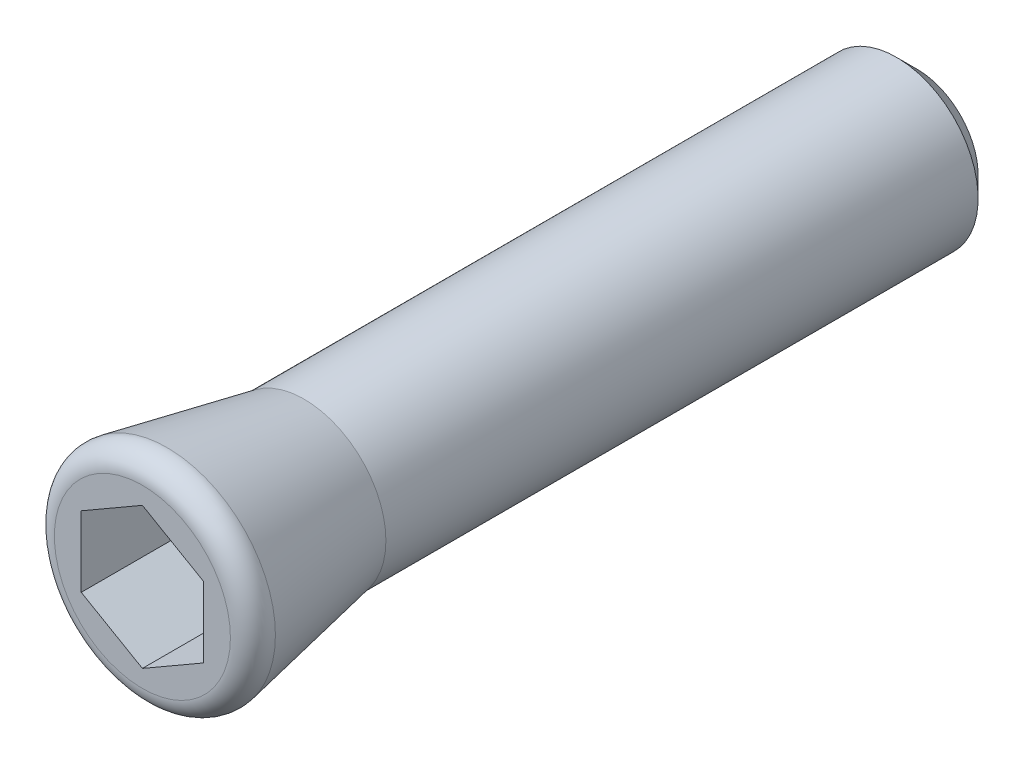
ISO-10303-21;
HEADER;
FILE_DESCRIPTION(('STEP AP214'),'2;1');
FILE_NAME('part.step','',(''),(''),'','','');
FILE_SCHEMA(('AUTOMOTIVE_DESIGN { 1 0 10303 214 1 1 1 1 }'));
ENDSEC;
DATA;
#1=APPLICATION_CONTEXT('core data for automotive mechanical design processes');
#2=APPLICATION_PROTOCOL_DEFINITION('international standard','automotive_design',2000,#1);
#3=PRODUCT_CONTEXT('',#1,'mechanical');
#4=PRODUCT('Part','Part','',(#3));
#5=PRODUCT_RELATED_PRODUCT_CATEGORY('part','',(#4));
#6=PRODUCT_DEFINITION_FORMATION('','',#4);
#7=PRODUCT_DEFINITION_CONTEXT('part definition',#1,'design');
#8=PRODUCT_DEFINITION('design','',#6,#7);
#9=PRODUCT_DEFINITION_SHAPE('','',#8);
#10=(LENGTH_UNIT() NAMED_UNIT(*) SI_UNIT(.MILLI.,.METRE.));
#11=(NAMED_UNIT(*) PLANE_ANGLE_UNIT() SI_UNIT($,.RADIAN.));
#12=(NAMED_UNIT(*) SI_UNIT($,.STERADIAN.) SOLID_ANGLE_UNIT());
#13=UNCERTAINTY_MEASURE_WITH_UNIT(LENGTH_MEASURE(1.E-05),#10,'distance_accuracy_value','');
#14=(GEOMETRIC_REPRESENTATION_CONTEXT(3) GLOBAL_UNCERTAINTY_ASSIGNED_CONTEXT((#13)) GLOBAL_UNIT_ASSIGNED_CONTEXT((#10,
#11,#12)) REPRESENTATION_CONTEXT('',''));
#15=CARTESIAN_POINT('',(0.,0.,0.));
#16=DIRECTION('',(0.,0.,1.));
#17=DIRECTION('',(1.,0.,0.));
#18=AXIS2_PLACEMENT_3D('',#15,#16,#17);
#19=CARTESIAN_POINT('',(0.,0.,-7.916));
#20=DIRECTION('',(0.,0.,-1.));
#21=DIRECTION('',(-1.,0.,0.));
#22=AXIS2_PLACEMENT_3D('',#19,#20,#21);
#23=CYLINDRICAL_SURFACE('',#22,4.);
#24=CARTESIAN_POINT('',(0.,0.,-36.996));
#25=DIRECTION('',(0.,0.,-1.));
#26=DIRECTION('',(-1.,0.,0.));
#27=AXIS2_PLACEMENT_3D('',#24,#25,#26);
#28=CIRCLE('',#27,4.);
#29=CARTESIAN_POINT('',(-4.,0.,-36.996));
#30=VERTEX_POINT('',#29);
#31=EDGE_CURVE('E22',#30,#30,#28,.F.);
#32=ORIENTED_EDGE('',*,*,#31,.T.);
#33=EDGE_LOOP('',(#32));
#34=FACE_BOUND('',#33,.T.);
#35=CARTESIAN_POINT('',(0.,0.,-7.9375));
#36=DIRECTION('',(0.,0.,-1.));
#37=DIRECTION('',(-1.,0.,0.));
#38=AXIS2_PLACEMENT_3D('',#35,#36,#37);
#39=CIRCLE('',#38,4.);
#40=CARTESIAN_POINT('',(-4.,0.,-7.9375));
#41=VERTEX_POINT('',#40);
#42=EDGE_CURVE('E132',#41,#41,#39,.T.);
#43=ORIENTED_EDGE('',*,*,#42,.T.);
#44=EDGE_LOOP('',(#43));
#45=FACE_BOUND('',#44,.T.);
#46=ADVANCED_FACE('F14',(#34,#45),#23,.T.);
#47=CARTESIAN_POINT('',(0.,0.,0.));
#48=DIRECTION('',(0.,0.,1.));
#49=DIRECTION('',(1.,0.,0.));
#50=AXIS2_PLACEMENT_3D('',#47,#48,#49);
#51=PLANE('',#50);
#52=DIRECTION('',(0.866025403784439,-0.5,0.));
#53=VECTOR('',#52,1.);
#54=CARTESIAN_POINT('',(-3.,-1.73205080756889,0.));
#55=LINE('',#54,#53);
#56=CARTESIAN_POINT('',(-3.,-1.73205080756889,0.));
#57=VERTEX_POINT('',#56);
#58=CARTESIAN_POINT('',(0.,-3.46410161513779,0.));
#59=VERTEX_POINT('',#58);
#60=EDGE_CURVE('E29',#57,#59,#55,.T.);
#61=ORIENTED_EDGE('',*,*,#60,.F.);
#62=DIRECTION('',(0.,-1.,0.));
#63=VECTOR('',#62,1.);
#64=CARTESIAN_POINT('',(-3.,1.73205080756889,0.));
#65=LINE('',#64,#63);
#66=CARTESIAN_POINT('',(-3.,1.73205080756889,0.));
#67=VERTEX_POINT('',#66);
#68=EDGE_CURVE('E99',#67,#57,#65,.T.);
#69=ORIENTED_EDGE('',*,*,#68,.F.);
#70=DIRECTION('',(-0.866025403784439,-0.5,0.));
#71=VECTOR('',#70,1.);
#72=CARTESIAN_POINT('',(0.,3.46410161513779,0.));
#73=LINE('',#72,#71);
#74=CARTESIAN_POINT('',(0.,3.46410161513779,0.));
#75=VERTEX_POINT('',#74);
#76=EDGE_CURVE('E93',#75,#67,#73,.T.);
#77=ORIENTED_EDGE('',*,*,#76,.F.);
#78=DIRECTION('',(-0.866025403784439,0.5,0.));
#79=VECTOR('',#78,1.);
#80=CARTESIAN_POINT('',(3.,1.73205080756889,0.));
#81=LINE('',#80,#79);
#82=CARTESIAN_POINT('',(3.,1.73205080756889,0.));
#83=VERTEX_POINT('',#82);
#84=EDGE_CURVE('E91',#83,#75,#81,.T.);
#85=ORIENTED_EDGE('',*,*,#84,.F.);
#86=DIRECTION('',(0.,1.,0.));
#87=VECTOR('',#86,1.);
#88=CARTESIAN_POINT('',(3.,-1.73205080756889,0.));
#89=LINE('',#88,#87);
#90=CARTESIAN_POINT('',(3.,-1.73205080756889,0.));
#91=VERTEX_POINT('',#90);
#92=EDGE_CURVE('E72',#91,#83,#89,.T.);
#93=ORIENTED_EDGE('',*,*,#92,.F.);
#94=DIRECTION('',(0.866025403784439,0.5,0.));
#95=VECTOR('',#94,1.);
#96=CARTESIAN_POINT('',(0.,-3.46410161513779,0.));
#97=LINE('',#96,#95);
#98=EDGE_CURVE('E83',#59,#91,#97,.T.);
#99=ORIENTED_EDGE('',*,*,#98,.F.);
#100=EDGE_LOOP('',(#61,#69,#77,#85,#93,#99));
#101=FACE_BOUND('',#100,.T.);
#102=CARTESIAN_POINT('',(0.,0.,0.));
#103=DIRECTION('',(0.,0.,1.));
#104=DIRECTION('',(1.,0.,0.));
#105=AXIS2_PLACEMENT_3D('',#102,#103,#104);
#106=CIRCLE('',#105,4.318);
#107=CARTESIAN_POINT('',(4.318,0.,0.));
#108=VERTEX_POINT('',#107);
#109=EDGE_CURVE('E117',#108,#108,#106,.T.);
#110=ORIENTED_EDGE('',*,*,#109,.T.);
#111=EDGE_LOOP('',(#110));
#112=FACE_BOUND('',#111,.T.);
#113=ADVANCED_FACE('F87',(#101,#112),#51,.T.);
#114=CARTESIAN_POINT('',(0.,0.,-1.20986193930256));
#115=DIRECTION('',(0.,0.,1.));
#116=DIRECTION('',(1.,0.,0.));
#117=AXIS2_PLACEMENT_3D('',#114,#115,#116);
#118=CONICAL_SURFACE('',#117,5.31533321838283,0.19198621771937);
#119=CARTESIAN_POINT('',(0.,0.,-7.9375));
#120=DIRECTION('',(0.,0.,1.));
#121=DIRECTION('',(1.,0.,0.));
#122=AXIS2_PLACEMENT_3D('',#119,#120,#121);
#123=CIRCLE('',#122,4.00761285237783);
#124=CARTESIAN_POINT('',(4.00761285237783,0.,-7.9375));
#125=VERTEX_POINT('',#124);
#126=EDGE_CURVE('E129',#125,#125,#123,.T.);
#127=ORIENTED_EDGE('',*,*,#126,.T.);
#128=EDGE_LOOP('',(#127));
#129=FACE_BOUND('',#128,.T.);
#130=CARTESIAN_POINT('',(0.,0.,-1.20986193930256));
#131=DIRECTION('',(0.,0.,1.));
#132=DIRECTION('',(1.,0.,0.));
#133=AXIS2_PLACEMENT_3D('',#130,#131,#132);
#134=CIRCLE('',#133,5.31533321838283);
#135=CARTESIAN_POINT('',(5.31533321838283,0.,-1.20986193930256));
#136=VERTEX_POINT('',#135);
#137=EDGE_CURVE('E126',#136,#136,#134,.T.);
#138=ORIENTED_EDGE('',*,*,#137,.F.);
#139=EDGE_LOOP('',(#138));
#140=FACE_BOUND('',#139,.T.);
#141=ADVANCED_FACE('F162',(#129,#140),#118,.T.);
#142=CARTESIAN_POINT('',(0.,0.,-1.016));
#143=DIRECTION('',(0.,0.,1.));
#144=DIRECTION('',(1.,0.,0.));
#145=AXIS2_PLACEMENT_3D('',#142,#143,#144);
#146=TOROIDAL_SURFACE('',#145,4.318,1.016);
#147=ORIENTED_EDGE('',*,*,#137,.T.);
#148=EDGE_LOOP('',(#147));
#149=FACE_BOUND('',#148,.T.);
#150=ORIENTED_EDGE('',*,*,#109,.F.);
#151=EDGE_LOOP('',(#150));
#152=FACE_BOUND('',#151,.T.);
#153=ADVANCED_FACE('F164',(#149,#152),#146,.T.);
#154=CARTESIAN_POINT('',(0.,5.95376,-7.9375));
#155=DIRECTION('',(0.,0.,-1.));
#156=DIRECTION('',(-1.,0.,0.));
#157=AXIS2_PLACEMENT_3D('',#154,#155,#156);
#158=PLANE('',#157);
#159=ORIENTED_EDGE('',*,*,#42,.F.);
#160=EDGE_LOOP('',(#159));
#161=FACE_BOUND('',#160,.T.);
#162=ORIENTED_EDGE('',*,*,#126,.F.);
#163=EDGE_LOOP('',(#162));
#164=FACE_BOUND('',#163,.T.);
#165=ADVANCED_FACE('F16',(#161,#164),#158,.T.);
#166=CARTESIAN_POINT('',(0.,0.,-37.996));
#167=DIRECTION('',(0.,0.,-1.));
#168=DIRECTION('',(-1.,0.,0.));
#169=AXIS2_PLACEMENT_3D('',#166,#167,#168);
#170=PLANE('',#169);
#171=CARTESIAN_POINT('',(0.,0.,-37.996));
#172=DIRECTION('',(0.,0.,-1.));
#173=DIRECTION('',(-1.,0.,0.));
#174=AXIS2_PLACEMENT_3D('',#171,#172,#173);
#175=CIRCLE('',#174,3.);
#176=CARTESIAN_POINT('',(-3.,0.,-37.996));
#177=VERTEX_POINT('',#176);
#178=EDGE_CURVE('E9',#177,#177,#175,.T.);
#179=ORIENTED_EDGE('',*,*,#178,.T.);
#180=EDGE_LOOP('',(#179));
#181=FACE_BOUND('',#180,.T.);
#182=ADVANCED_FACE('F142',(#181),#170,.T.);
#183=CARTESIAN_POINT('',(0.,0.,-36.996));
#184=DIRECTION('',(0.,0.,1.));
#185=DIRECTION('',(1.,0.,0.));
#186=AXIS2_PLACEMENT_3D('',#183,#184,#185);
#187=CONICAL_SURFACE('',#186,4.,0.785398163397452);
#188=ORIENTED_EDGE('',*,*,#178,.F.);
#189=EDGE_LOOP('',(#188));
#190=FACE_BOUND('',#189,.T.);
#191=ORIENTED_EDGE('',*,*,#31,.F.);
#192=EDGE_LOOP('',(#191));
#193=FACE_BOUND('',#192,.T.);
#194=ADVANCED_FACE('F139',(#190,#193),#187,.T.);
#195=CARTESIAN_POINT('',(-3.,-1.73205080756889,-4.5));
#196=DIRECTION('',(-0.5,-0.866025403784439,0.));
#197=DIRECTION('',(-0.866025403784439,0.5,0.));
#198=AXIS2_PLACEMENT_3D('',#195,#196,#197);
#199=PLANE('',#198);
#200=ORIENTED_EDGE('',*,*,#60,.T.);
#201=DIRECTION('',(0.,0.,1.));
#202=VECTOR('',#201,1.);
#203=CARTESIAN_POINT('',(0.,-3.46410161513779,-4.5));
#204=LINE('',#203,#202);
#205=CARTESIAN_POINT('',(0.,-3.46410161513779,-4.5));
#206=VERTEX_POINT('',#205);
#207=EDGE_CURVE('E80',#206,#59,#204,.T.);
#208=ORIENTED_EDGE('',*,*,#207,.F.);
#209=DIRECTION('',(0.866025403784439,-0.5,0.));
#210=VECTOR('',#209,1.);
#211=CARTESIAN_POINT('',(-3.,-1.73205080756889,-4.5));
#212=LINE('',#211,#210);
#213=CARTESIAN_POINT('',(-3.,-1.73205080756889,-4.5));
#214=VERTEX_POINT('',#213);
#215=EDGE_CURVE('E101',#214,#206,#212,.T.);
#216=ORIENTED_EDGE('',*,*,#215,.F.);
#217=DIRECTION('',(0.,0.,1.));
#218=VECTOR('',#217,1.);
#219=CARTESIAN_POINT('',(-3.,-1.73205080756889,-4.5));
#220=LINE('',#219,#218);
#221=EDGE_CURVE('E36',#214,#57,#220,.T.);
#222=ORIENTED_EDGE('',*,*,#221,.T.);
#223=EDGE_LOOP('',(#200,#208,#216,#222));
#224=FACE_BOUND('',#223,.T.);
#225=ADVANCED_FACE('F141',(#224),#199,.F.);
#226=CARTESIAN_POINT('',(-3.,1.73205080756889,-4.5));
#227=DIRECTION('',(-1.,0.,0.));
#228=DIRECTION('',(0.,1.,0.));
#229=AXIS2_PLACEMENT_3D('',#226,#227,#228);
#230=PLANE('',#229);
#231=ORIENTED_EDGE('',*,*,#68,.T.);
#232=ORIENTED_EDGE('',*,*,#221,.F.);
#233=DIRECTION('',(0.,-1.,0.));
#234=VECTOR('',#233,1.);
#235=CARTESIAN_POINT('',(-3.,1.73205080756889,-4.5));
#236=LINE('',#235,#234);
#237=CARTESIAN_POINT('',(-3.,1.73205080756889,-4.5));
#238=VERTEX_POINT('',#237);
#239=EDGE_CURVE('E113',#238,#214,#236,.T.);
#240=ORIENTED_EDGE('',*,*,#239,.F.);
#241=DIRECTION('',(0.,0.,1.));
#242=VECTOR('',#241,1.);
#243=CARTESIAN_POINT('',(-3.,1.73205080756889,-4.5));
#244=LINE('',#243,#242);
#245=EDGE_CURVE('E118',#238,#67,#244,.T.);
#246=ORIENTED_EDGE('',*,*,#245,.T.);
#247=EDGE_LOOP('',(#231,#232,#240,#246));
#248=FACE_BOUND('',#247,.T.);
#249=ADVANCED_FACE('F151',(#248),#230,.F.);
#250=CARTESIAN_POINT('',(0.,3.46410161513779,-4.5));
#251=DIRECTION('',(-0.5,0.866025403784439,0.));
#252=DIRECTION('',(0.866025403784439,0.5,0.));
#253=AXIS2_PLACEMENT_3D('',#250,#251,#252);
#254=PLANE('',#253);
#255=ORIENTED_EDGE('',*,*,#76,.T.);
#256=ORIENTED_EDGE('',*,*,#245,.F.);
#257=DIRECTION('',(-0.866025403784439,-0.5,0.));
#258=VECTOR('',#257,1.);
#259=CARTESIAN_POINT('',(0.,3.46410161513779,-4.5));
#260=LINE('',#259,#258);
#261=CARTESIAN_POINT('',(0.,3.46410161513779,-4.5));
#262=VERTEX_POINT('',#261);
#263=EDGE_CURVE('E110',#262,#238,#260,.T.);
#264=ORIENTED_EDGE('',*,*,#263,.F.);
#265=DIRECTION('',(0.,0.,1.));
#266=VECTOR('',#265,1.);
#267=CARTESIAN_POINT('',(0.,3.46410161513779,-4.5));
#268=LINE('',#267,#266);
#269=EDGE_CURVE('E120',#262,#75,#268,.T.);
#270=ORIENTED_EDGE('',*,*,#269,.T.);
#271=EDGE_LOOP('',(#255,#256,#264,#270));
#272=FACE_BOUND('',#271,.T.);
#273=ADVANCED_FACE('F234',(#272),#254,.F.);
#274=CARTESIAN_POINT('',(3.,1.73205080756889,-4.5));
#275=DIRECTION('',(0.5,0.866025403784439,0.));
#276=DIRECTION('',(0.866025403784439,-0.5,0.));
#277=AXIS2_PLACEMENT_3D('',#274,#275,#276);
#278=PLANE('',#277);
#279=ORIENTED_EDGE('',*,*,#84,.T.);
#280=ORIENTED_EDGE('',*,*,#269,.F.);
#281=DIRECTION('',(-0.866025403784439,0.5,0.));
#282=VECTOR('',#281,1.);
#283=CARTESIAN_POINT('',(3.,1.73205080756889,-4.5));
#284=LINE('',#283,#282);
#285=CARTESIAN_POINT('',(3.,1.73205080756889,-4.5));
#286=VERTEX_POINT('',#285);
#287=EDGE_CURVE('E107',#286,#262,#284,.T.);
#288=ORIENTED_EDGE('',*,*,#287,.F.);
#289=DIRECTION('',(0.,0.,1.));
#290=VECTOR('',#289,1.);
#291=CARTESIAN_POINT('',(3.,1.73205080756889,-4.5));
#292=LINE('',#291,#290);
#293=EDGE_CURVE('E79',#286,#83,#292,.T.);
#294=ORIENTED_EDGE('',*,*,#293,.T.);
#295=EDGE_LOOP('',(#279,#280,#288,#294));
#296=FACE_BOUND('',#295,.T.);
#297=ADVANCED_FACE('F241',(#296),#278,.F.);
#298=CARTESIAN_POINT('',(3.,-1.73205080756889,-4.5));
#299=DIRECTION('',(1.,0.,0.));
#300=DIRECTION('',(0.,-1.,0.));
#301=AXIS2_PLACEMENT_3D('',#298,#299,#300);
#302=PLANE('',#301);
#303=ORIENTED_EDGE('',*,*,#92,.T.);
#304=ORIENTED_EDGE('',*,*,#293,.F.);
#305=DIRECTION('',(0.,1.,0.));
#306=VECTOR('',#305,1.);
#307=CARTESIAN_POINT('',(3.,-1.73205080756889,-4.5));
#308=LINE('',#307,#306);
#309=CARTESIAN_POINT('',(3.,-1.73205080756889,-4.5));
#310=VERTEX_POINT('',#309);
#311=EDGE_CURVE('E75',#310,#286,#308,.T.);
#312=ORIENTED_EDGE('',*,*,#311,.F.);
#313=DIRECTION('',(0.,0.,1.));
#314=VECTOR('',#313,1.);
#315=CARTESIAN_POINT('',(3.,-1.73205080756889,-4.5));
#316=LINE('',#315,#314);
#317=EDGE_CURVE('E68',#310,#91,#316,.T.);
#318=ORIENTED_EDGE('',*,*,#317,.T.);
#319=EDGE_LOOP('',(#303,#304,#312,#318));
#320=FACE_BOUND('',#319,.T.);
#321=ADVANCED_FACE('F70',(#320),#302,.F.);
#322=CARTESIAN_POINT('',(0.,-3.46410161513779,-4.5));
#323=DIRECTION('',(0.5,-0.866025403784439,0.));
#324=DIRECTION('',(-0.866025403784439,-0.5,0.));
#325=AXIS2_PLACEMENT_3D('',#322,#323,#324);
#326=PLANE('',#325);
#327=ORIENTED_EDGE('',*,*,#98,.T.);
#328=ORIENTED_EDGE('',*,*,#317,.F.);
#329=DIRECTION('',(0.866025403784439,0.5,0.));
#330=VECTOR('',#329,1.);
#331=CARTESIAN_POINT('',(0.,-3.46410161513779,-4.5));
#332=LINE('',#331,#330);
#333=EDGE_CURVE('E104',#206,#310,#332,.T.);
#334=ORIENTED_EDGE('',*,*,#333,.F.);
#335=ORIENTED_EDGE('',*,*,#207,.T.);
#336=EDGE_LOOP('',(#327,#328,#334,#335));
#337=FACE_BOUND('',#336,.T.);
#338=ADVANCED_FACE('F84',(#337),#326,.F.);
#339=CARTESIAN_POINT('',(3.,-5.19615242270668,-4.5));
#340=DIRECTION('',(0.,0.,1.));
#341=DIRECTION('',(1.,0.,0.));
#342=AXIS2_PLACEMENT_3D('',#339,#340,#341);
#343=PLANE('',#342);
#344=ORIENTED_EDGE('',*,*,#215,.T.);
#345=ORIENTED_EDGE('',*,*,#333,.T.);
#346=ORIENTED_EDGE('',*,*,#311,.T.);
#347=ORIENTED_EDGE('',*,*,#287,.T.);
#348=ORIENTED_EDGE('',*,*,#263,.T.);
#349=ORIENTED_EDGE('',*,*,#239,.T.);
#350=EDGE_LOOP('',(#344,#345,#346,#347,#348,#349));
#351=FACE_BOUND('',#350,.T.);
#352=ADVANCED_FACE('F265',(#351),#343,.T.);
#353=CLOSED_SHELL('',(#46,#113,#141,#153,#165,#182,#194,#225,#249,#273,#297,#321,#338,#352));
#354=MANIFOLD_SOLID_BREP('B1',#353);
#355=ADVANCED_BREP_SHAPE_REPRESENTATION('',(#18,#354),#14);
#356=SHAPE_DEFINITION_REPRESENTATION(#9,#355);
ENDSEC;
END-ISO-10303-21;
